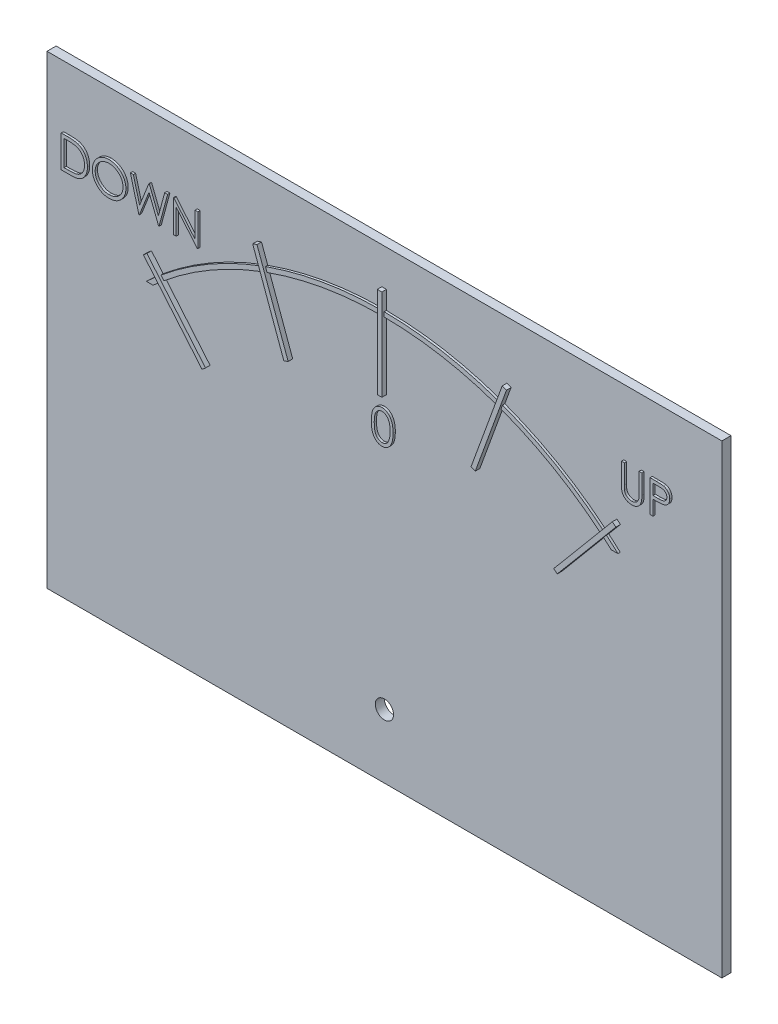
from build123d import *

# Parameters (mm, degrees)
ESQUISSE1_W             = 74
ESQUISSE1_H             = 51
BOSS_EXTRU_1_DEPTH      = 1
ESQUISSE2_R             = 1
ENL_V_MAT_EXTRU_1_DEPTH = 90.877694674
BOSS_EXTRU_2_DEPTH      = 0.25
BOSS_EXTRU_4_DEPTH      = 0.25
BOSS_EXTRU_5_DEPTH      = 0.25
ESQUISSE8_W             = 0.5
ESQUISSE8_H             = 10
BOSS_EXTRU_7_DEPTH      = 0.5
BOSS_EXTRU_8_DEPTH      = 0.25


with BuildPart() as part:
    # Esquisse1 → Boss.-Extru.1 (new body)
    with BuildSketch(Plane.XY):
        with Locations((37, 25.5)):
            Rectangle(ESQUISSE1_W, ESQUISSE1_H)
    extrude(amount=BOSS_EXTRU_1_DEPTH)

    # Esquisse2 → Enl_v. mat.-Extru.1 (cut, through all)
    with BuildSketch(Plane.XY.offset(1)):
        with Locations((37, 7)):
            Circle(ESQUISSE2_R)
    extrude(amount=-ENL_V_MAT_EXTRU_1_DEPTH, mode=Mode.SUBTRACT)

    # Esquisse3 → Boss.-Extru.2 (add)
    with BuildSketch(Plane.XY.offset(1)):
        with BuildLine():
            Line((11.145245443, 34.848369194), (11.88589374, 34.848369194))
            ThreePointArc((11.88589374, 34.848369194), (37, 44.5), (62.11410626, 34.848369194))
            Line((62.11410626, 34.848369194), (62.854754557, 34.848369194))
            ThreePointArc((62.854754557, 34.848369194), (37, 45), (11.145245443, 34.848369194))
        make_face()
    extrude(amount=BOSS_EXTRU_2_DEPTH)

    # Esquisse6 → Boss.-Extru.4 (add)
    # profile 1 of 4: a face of its own
    with BuildSketch(Plane.XY.offset(1)):
        with BuildLine():
            Line((1.810400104, 40.77481565), (1.810400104, 44.27481565))
            Line((1.810400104, 44.27481565), (2.517130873, 44.27481565))
            add(Edge.make_bspline(
                [(2.517130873, 44.27481565), (2.578599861, 44.27437308), (2.697357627, 44.273518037), (2.868970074, 44.268096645), (3.027753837, 44.25850618), (3.173186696, 44.244536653), (3.305667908, 44.22738362), (3.424826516, 44.205883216), (3.531278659, 44.180495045), (3.596748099, 44.158849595), (3.627707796, 44.148613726)],
                knots=[0, 0, 0, 0, 1.314313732, 2.53924729, 3.670748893, 4.714932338, 5.66265055, 6.526160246, 7.303039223, 8, 8, 8, 8], degree=3))
            add(Edge.make_bspline(
                [(3.627707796, 44.148613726), (3.668202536, 44.133183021), (3.748273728, 44.102671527), (3.86228085, 44.045115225), (3.969606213, 43.979902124), (4.070825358, 43.906946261), (4.163626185, 43.824181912), (4.251634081, 43.735124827), (4.331248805, 43.636536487), (4.404157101, 43.530461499), (4.469892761, 43.418149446), (4.527031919, 43.299814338), (4.574485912, 43.17605713), (4.613879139, 43.047221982), (4.644925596, 42.913025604), (4.666107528, 42.773311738), (4.680078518, 42.628632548), (4.681482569, 42.530458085), (4.682194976, 42.480644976)],
                knots=[0, 0, 0, 0, 0.984719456, 1.947108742, 2.898477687, 3.838006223, 4.779231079, 5.722358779, 6.681677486, 7.655904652, 8.64651281, 9.637519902, 10.640069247, 11.656948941, 12.698408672, 13.768548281, 14.867775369, 16, 16, 16, 16], degree=3))
            add(Edge.make_bspline(
                [(4.682194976, 42.480644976), (4.681566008, 42.437383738), (4.680326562, 42.352132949), (4.669197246, 42.226492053), (4.653020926, 42.104578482), (4.627976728, 41.986972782), (4.597574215, 41.872644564), (4.558610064, 41.76281232), (4.513974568, 41.65646851), (4.461924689, 41.555051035), (4.404783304, 41.458967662), (4.343461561, 41.368392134), (4.278024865, 41.284616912), (4.207849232, 41.2073883), (4.133841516, 41.136822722), (4.055517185, 41.072330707), (3.972674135, 41.015174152), (3.885683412, 40.963107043), (3.792007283, 40.917686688), (3.689871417, 40.879256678), (3.578840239, 40.847410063), (3.459186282, 40.820839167), (3.330702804, 40.799761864), (3.193263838, 40.785635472), (3.047080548, 40.776082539), (2.946701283, 40.775246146), (2.895035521, 40.77481565)],
                knots=[0, 0, 0, 0, 1.105936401, 2.179363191, 3.223086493, 4.248585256, 5.251745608, 6.245858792, 7.225916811, 8.198733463, 9.158002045, 10.082870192, 10.993790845, 11.873723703, 12.748670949, 13.606408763, 14.465103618, 15.319838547, 16.196477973, 17.123216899, 18.106603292, 19.147568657, 20.255746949, 21.433717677, 22.679120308, 24, 24, 24, 24], degree=3))
            Line((2.895035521, 40.77481565), (1.810400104, 40.77481565))
        make_face()
        with BuildLine():
            Line((2.124502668, 41.133790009), (2.526245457, 41.133790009))
            add(Edge.make_bspline(
                [(2.526245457, 41.133790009), (2.583973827, 41.134038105), (2.695006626, 41.134515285), (2.854664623, 41.138702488), (3.000544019, 41.145544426), (3.132665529, 41.155119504), (3.250954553, 41.167788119), (3.355658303, 41.181913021), (3.446433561, 41.199510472), (3.501362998, 41.215461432), (3.526746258, 41.222832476)],
                knots=[0, 0, 0, 0, 1.375205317, 2.645023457, 3.804390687, 4.853969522, 5.800190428, 6.637939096, 7.370582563, 8, 8, 8, 8], degree=3))
            add(Edge.make_bspline(
                [(3.526746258, 41.222832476), (3.55869462, 41.234084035), (3.621828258, 41.256318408), (3.712709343, 41.296876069), (3.797466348, 41.344918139), (3.877576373, 41.398320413), (3.951903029, 41.458966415), (4.021327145, 41.525537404), (4.085708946, 41.598372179), (4.144383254, 41.67738034), (4.196891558, 41.762070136), (4.242362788, 41.85160897), (4.282214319, 41.94501578), (4.313492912, 42.043724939), (4.338008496, 42.146853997), (4.355373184, 42.25441021), (4.366187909, 42.366373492), (4.367449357, 42.442525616), (4.368092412, 42.481346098)],
                knots=[0, 0, 0, 0, 0.998632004, 1.973411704, 2.929992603, 3.868527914, 4.809262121, 5.754881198, 6.702106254, 7.672490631, 8.653608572, 9.636854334, 10.631411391, 11.644891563, 12.686317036, 13.754757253, 14.855430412, 16, 16, 16, 16], degree=3))
            add(Edge.make_bspline(
                [(4.368092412, 42.481346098), (4.367579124, 42.522279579), (4.366570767, 42.602693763), (4.353896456, 42.720684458), (4.335374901, 42.834165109), (4.308591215, 42.943143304), (4.274460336, 43.047831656), (4.231865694, 43.147651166), (4.183199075, 43.243656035), (4.125295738, 43.333630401), (4.061880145, 43.41872351), (3.991502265, 43.496678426), (3.915280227, 43.567672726), (3.834045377, 43.632812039), (3.745508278, 43.689475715), (3.651754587, 43.740162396), (3.551408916, 43.783178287), (3.48159622, 43.80605715), (3.446117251, 43.817684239)],
                knots=[0, 0, 0, 0, 1.122418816, 2.205001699, 3.251619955, 4.274784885, 5.280384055, 6.268708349, 7.249350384, 8.229342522, 9.199999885, 10.157847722, 11.105861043, 12.055065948, 13.010012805, 13.98527497, 14.976112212, 16, 16, 16, 16], degree=3))
            add(Edge.make_bspline(
                [(3.446117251, 43.817684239), (3.416766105, 43.825800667), (3.354357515, 43.84305842), (3.252518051, 43.861883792), (3.137902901, 43.878488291), (3.0100032, 43.892546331), (2.868964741, 43.902633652), (2.714679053, 43.910204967), (2.547079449, 43.915311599), (2.430896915, 43.915660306), (2.370596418, 43.915841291)],
                knots=[0, 0, 0, 0, 0.674548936, 1.434276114, 2.292660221, 3.240891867, 4.284742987, 5.42552168, 6.663806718, 8, 8, 8, 8], degree=3))
            Line((2.370596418, 43.915841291), (2.124502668, 43.915841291))
            Line((2.124502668, 43.915841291), (2.124502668, 41.133790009))
        make_face(mode=Mode.SUBTRACT)
    # profile 2 of 4: a face of its own
    with BuildSketch(Plane.XY.offset(1)):
        with BuildLine():
            add(Edge.make_bspline(
                [(7.037964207, 44.364559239), (7.102772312, 44.36291776), (7.230060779, 44.359693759), (7.417135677, 44.335014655), (7.595730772, 44.292319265), (7.767300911, 44.235456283), (7.929793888, 44.159601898), (8.08443278, 44.067916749), (8.230849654, 43.959440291), (8.367071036, 43.835011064), (8.491727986, 43.69962761), (8.601553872, 43.5551497), (8.693596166, 43.402450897), (8.769181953, 43.241990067), (8.828480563, 43.074130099), (8.869399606, 42.897976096), (8.895537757, 42.714669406), (8.898593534, 42.589642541), (8.900143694, 42.526217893)],
                knots=[0, 0, 0, 0, 1.065120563, 2.091984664, 3.0946048, 4.079830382, 5.057816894, 6.036188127, 7.030412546, 8.04752943, 9.064399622, 10.05169764, 11.02544977, 11.989514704, 12.962713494, 13.945757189, 14.957906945, 16, 16, 16, 16], degree=3))
            add(Edge.make_bspline(
                [(8.900143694, 42.526217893), (8.898593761, 42.463260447), (8.895538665, 42.339164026), (8.869369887, 42.157020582), (8.828328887, 41.981929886), (8.769732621, 41.814184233), (8.694507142, 41.653606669), (8.601851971, 41.500619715), (8.492710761, 41.355173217), (8.36850391, 41.218860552), (8.233102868, 41.093863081), (8.087872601, 40.984944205), (7.936079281, 40.891220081), (7.775769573, 40.816436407), (7.609069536, 40.756664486), (7.434487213, 40.715911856), (7.252840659, 40.689624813), (7.128969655, 40.686606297), (7.066009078, 40.68507206)],
                knots=[0, 0, 0, 0, 1.043624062, 2.057103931, 3.04512605, 4.022047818, 4.998200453, 5.980619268, 6.982898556, 8.009068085, 9.034988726, 10.034168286, 11.015286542, 11.987931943, 12.962482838, 13.94673481, 14.956375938, 16, 16, 16, 16], degree=3))
            add(Edge.make_bspline(
                [(7.066009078, 40.68507206), (7.002584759, 40.686621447), (6.877558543, 40.689675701), (6.694021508, 40.715857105), (6.517743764, 40.756798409), (6.349229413, 40.815307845), (6.188384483, 40.890925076), (6.034894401, 40.983129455), (5.889375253, 41.092536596), (5.753033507, 41.216703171), (5.628284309, 41.351874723), (5.519524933, 41.496708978), (5.42729982, 41.648364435), (5.351936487, 41.807261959), (5.292272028, 41.972633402), (5.25156721, 42.145581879), (5.225231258, 42.325121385), (5.222196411, 42.447364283), (5.220656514, 42.50939097)],
                knots=[0, 0, 0, 0, 1.053102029, 2.075944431, 3.073151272, 4.055350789, 5.033113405, 6.020478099, 7.024410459, 8.052272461, 9.079885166, 10.07527673, 11.055994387, 12.023226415, 12.992069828, 13.970394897, 14.97016774, 16, 16, 16, 16], degree=3))
            add(Edge.make_bspline(
                [(5.220656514, 42.50939097), (5.22119115, 42.551023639), (5.222253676, 42.633763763), (5.235045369, 42.756630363), (5.25360707, 42.877521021), (5.280208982, 42.996091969), (5.315000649, 43.112052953), (5.356052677, 43.226203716), (5.406192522, 43.33738744), (5.46287317, 43.446130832), (5.526134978, 43.550738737), (5.596010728, 43.649618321), (5.670046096, 43.743599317), (5.75120949, 43.830246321), (5.836825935, 43.912079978), (5.928284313, 43.987842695), (6.025026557, 44.058217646), (6.127468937, 44.121637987), (6.233087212, 44.178997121), (6.34196399, 44.228218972), (6.452620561, 44.270465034), (6.565575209, 44.304705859), (6.680527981, 44.331737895), (6.797729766, 44.350145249), (6.917087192, 44.362969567), (6.997498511, 44.364027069), (7.037964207, 44.364559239)],
                knots=[0, 0, 0, 0, 1.037015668, 2.060948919, 3.074880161, 4.083647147, 5.086022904, 6.090072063, 7.104153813, 8.122640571, 9.144368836, 10.147691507, 11.138137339, 12.123020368, 13.103399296, 14.087645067, 15.080126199, 16.082011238, 17.087798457, 18.072939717, 19.057185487, 20.037253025, 21.01195951, 21.997135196, 22.992090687, 24, 24, 24, 24], degree=3))
        make_face()
        with BuildLine():
            add(Edge.make_bspline(
                [(7.053388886, 44.00558488), (7.020174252, 44.00517999), (6.95406252, 44.00437408), (6.855777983, 43.993758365), (6.758786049, 43.978628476), (6.663066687, 43.957046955), (6.569020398, 43.927642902), (6.475770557, 43.893801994), (6.384167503, 43.852580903), (6.294513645, 43.806008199), (6.20759857, 43.754459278), (6.125585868, 43.697487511), (6.048263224, 43.636428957), (5.975819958, 43.57114112), (5.908468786, 43.501291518), (5.844884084, 43.427939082), (5.787614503, 43.348987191), (5.735128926, 43.266576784), (5.688161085, 43.180815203), (5.646395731, 43.09260534), (5.612231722, 43.001227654), (5.584369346, 42.907673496), (5.561269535, 42.812091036), (5.546635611, 42.713755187), (5.535903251, 42.613160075), (5.535143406, 42.545178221), (5.534759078, 42.510793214)],
                knots=[0, 0, 0, 0, 1.008559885, 2.007477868, 2.99961109, 3.989939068, 4.984837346, 5.991145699, 7.001802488, 8.033829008, 9.059044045, 10.069351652, 11.065060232, 12.050310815, 13.029377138, 14.011219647, 14.996725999, 15.989392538, 16.977580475, 17.965360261, 18.951710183, 19.937753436, 20.929683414, 21.935841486, 22.955955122, 24, 24, 24, 24], degree=3))
            add(Edge.make_bspline(
                [(5.534759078, 42.510793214), (5.53603394, 42.460230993), (5.538541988, 42.360759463), (5.560499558, 42.214991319), (5.594321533, 42.074903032), (5.644178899, 41.941261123), (5.706529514, 41.81291684), (5.783556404, 41.691008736), (5.87481549, 41.575503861), (5.978479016, 41.467208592), (6.091801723, 41.368362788), (6.212134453, 41.281599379), (6.33818806, 41.208189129), (6.470291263, 41.148384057), (6.607738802, 41.100994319), (6.751416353, 41.068515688), (6.900366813, 41.047140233), (7.001897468, 41.045087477), (7.053388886, 41.044046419)],
                knots=[0, 0, 0, 0, 1.032063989, 2.030389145, 3.003944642, 3.970395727, 4.937377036, 5.913328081, 6.909231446, 7.93887556, 8.970685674, 9.976071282, 10.964166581, 11.944589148, 12.933237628, 13.927779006, 14.949070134, 16, 16, 16, 16], degree=3))
            add(Edge.make_bspline(
                [(7.053388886, 41.044046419), (7.087998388, 41.044521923), (7.156639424, 41.045464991), (7.258734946, 41.054963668), (7.358991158, 41.070195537), (7.457267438, 41.092126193), (7.553452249, 41.119573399), (7.647947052, 41.152181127), (7.739745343, 41.192862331), (7.830005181, 41.237810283), (7.916401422, 41.28905044), (7.998876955, 41.34408859), (8.075352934, 41.405057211), (8.147742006, 41.469375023), (8.215369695, 41.538338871), (8.277778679, 41.611859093), (8.334758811, 41.69039975), (8.387224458, 41.772685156), (8.434027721, 41.858681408), (8.47480682, 41.947211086), (8.509402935, 42.038056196), (8.53733144, 42.131347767), (8.559216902, 42.226908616), (8.574296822, 42.324866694), (8.584845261, 42.425026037), (8.585640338, 42.492769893), (8.58604113, 42.526919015)],
                knots=[0, 0, 0, 0, 1.047197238, 2.076906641, 3.100256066, 4.114471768, 5.12198147, 6.126382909, 7.136867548, 8.15857795, 9.17633901, 10.174870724, 11.156907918, 12.133735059, 13.104061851, 14.077631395, 15.04955518, 16.038496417, 17.029181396, 18.010275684, 18.986308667, 19.968651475, 20.955262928, 21.950658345, 22.966943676, 24, 24, 24, 24], degree=3))
            add(Edge.make_bspline(
                [(8.58604113, 42.526919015), (8.585640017, 42.560834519), (8.584844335, 42.628112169), (8.574301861, 42.727572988), (8.55920097, 42.824826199), (8.537438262, 42.919490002), (8.509388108, 43.011588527), (8.474800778, 43.101035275), (8.434015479, 43.18816347), (8.387207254, 43.272757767), (8.334591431, 43.353932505), (8.277097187, 43.431534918), (8.213731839, 43.504107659), (8.146305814, 43.573442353), (8.073134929, 43.638060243), (7.994550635, 43.697982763), (7.911506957, 43.754656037), (7.823579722, 43.805781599), (7.732835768, 43.852995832), (7.63972181, 43.893446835), (7.54529271, 43.927818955), (7.449788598, 43.95713592), (7.35240562, 43.97854395), (7.253801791, 43.993772), (7.154113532, 44.004370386), (7.087070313, 44.005178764), (7.053388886, 44.00558488)],
                knots=[0, 0, 0, 0, 1.02996197, 2.043119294, 3.035359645, 4.018872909, 4.991431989, 5.957985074, 6.929999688, 7.912076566, 8.892894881, 9.867085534, 10.843653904, 11.817741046, 12.803660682, 13.806313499, 14.818574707, 15.856120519, 16.894564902, 17.924820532, 18.937903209, 19.946497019, 20.957711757, 21.963978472, 22.977135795, 24, 24, 24, 24], degree=3))
        make_face(mode=Mode.SUBTRACT)
    # profile 3 of 4: a face of its own
    with BuildSketch(Plane.XY.offset(1)):
        Polygon((9.393733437, 44.27481565), (9.718352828, 44.27481565), (10.403348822, 41.708008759), (11.42207879, 44.27481565), (11.467651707, 44.27481565), (12.467451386, 41.725536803), (13.155952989, 44.27481565), (13.477066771, 44.27481565), (12.533356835, 40.77481565), (12.48848504, 40.77481565), (11.435400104, 43.451698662), (10.369694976, 40.77481565), (10.324823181, 40.77481565), align=None)
    # profile 4 of 4: a face of its own
    with BuildSketch(Plane.XY.offset(1)):
        Polygon((14.105271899, 40.77481565), (14.105271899, 44.27481565), (14.171177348, 44.27481565), (16.483477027, 41.520108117), (16.483477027, 44.27481565), (16.797579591, 44.27481565), (16.797579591, 40.77481565), (16.726065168, 40.77481565), (14.419374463, 43.523213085), (14.419374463, 40.77481565), align=None)
    extrude(amount=BOSS_EXTRU_4_DEPTH)

    # Esquisse7 → Boss.-Extru.5 (add)
    # profile 1 of 2: a face of its own
    with BuildSketch(Plane.XY.offset(1)):
        with BuildLine():
            Line((63.237395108, 43.820921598), (63.551497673, 43.820921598))
            Line((63.551497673, 43.820921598), (63.551497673, 41.723866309))
            add(Edge.make_bspline(
                [(63.551497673, 41.723866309), (63.551450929, 41.694185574), (63.551362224, 41.637861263), (63.551954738, 41.557692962), (63.553614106, 41.486420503), (63.554660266, 41.423769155), (63.556987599, 41.370026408), (63.558885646, 41.324901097), (63.561326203, 41.288606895), (63.56425932, 41.267425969), (63.565520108, 41.258321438)],
                knots=[0, 0, 0, 0, 1.528628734, 2.90083645, 4.128790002, 5.200304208, 6.127813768, 6.898992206, 7.526736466, 8, 8, 8, 8], degree=3))
            add(Edge.make_bspline(
                [(63.565520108, 41.258321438), (63.570697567, 41.225474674), (63.580760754, 41.161631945), (63.606407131, 41.070723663), (63.642224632, 40.988792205), (63.684667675, 40.913280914), (63.740600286, 40.846291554), (63.807603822, 40.784579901), (63.88878159, 40.730608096), (63.979042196, 40.681257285), (64.076327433, 40.641592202), (64.1757387, 40.611598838), (64.275781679, 40.593319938), (64.342757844, 40.591203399), (64.376016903, 40.590152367)],
                knots=[0, 0, 0, 0, 1.035780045, 2.013197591, 2.933192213, 3.817615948, 4.702609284, 5.640816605, 6.646850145, 7.73207398, 8.84249596, 9.914020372, 10.964143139, 12, 12, 12, 12], degree=3))
            add(Edge.make_bspline(
                [(64.376016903, 40.590152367), (64.404570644, 40.591226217), (64.461513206, 40.593367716), (64.546119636, 40.606629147), (64.628519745, 40.630529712), (64.709120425, 40.661369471), (64.784671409, 40.702117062), (64.855214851, 40.749187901), (64.918178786, 40.804398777), (64.975636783, 40.865499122), (65.025671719, 40.934438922), (65.069042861, 41.00971706), (65.10456879, 41.092466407), (65.122112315, 41.150620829), (65.131125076, 41.180496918)],
                knots=[0, 0, 0, 0, 0.994687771, 1.983630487, 2.973142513, 3.978332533, 4.983357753, 5.956394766, 6.925816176, 7.893390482, 8.871859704, 9.88551698, 10.913711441, 12, 12, 12, 12], degree=3))
            add(Edge.make_bspline(
                [(65.131125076, 41.180496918), (65.134125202, 41.192845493), (65.14081069, 41.220363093), (65.147057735, 41.266884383), (65.15356426, 41.321773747), (65.15807883, 41.38542556), (65.162480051, 41.457626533), (65.165113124, 41.53875279), (65.166330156, 41.628509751), (65.166692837, 41.691146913), (65.166882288, 41.723866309)],
                knots=[0, 0, 0, 0, 0.558680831, 1.244966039, 2.062412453, 2.990489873, 4.051219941, 5.244515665, 6.560634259, 8, 8, 8, 8], degree=3))
            Line((65.166882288, 41.723866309), (65.166882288, 43.820921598))
            Line((65.166882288, 43.820921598), (65.480984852, 43.820921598))
            Line((65.480984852, 43.820921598), (65.480984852, 41.707039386))
            add(Edge.make_bspline(
                [(65.480984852, 41.707039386), (65.480730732, 41.668941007), (65.4802348, 41.594589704), (65.475934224, 41.485638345), (65.469077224, 41.382285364), (65.459389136, 41.284516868), (65.446552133, 41.192682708), (65.432276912, 41.10597794), (65.414097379, 41.025024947), (65.392863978, 40.94919253), (65.36859043, 40.877007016), (65.337149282, 40.808498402), (65.301724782, 40.741584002), (65.259710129, 40.677275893), (65.212498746, 40.61528934), (65.159047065, 40.556000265), (65.101122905, 40.498461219), (65.037763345, 40.444148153), (64.97001282, 40.394339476), (64.898072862, 40.350541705), (64.822496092, 40.313518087), (64.743478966, 40.283042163), (64.660987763, 40.260127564), (64.575020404, 40.243052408), (64.48538121, 40.23335011), (64.424416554, 40.23190818), (64.393544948, 40.231178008)],
                knots=[0, 0, 0, 0, 1.316592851, 2.569410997, 3.76748051, 4.895814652, 5.963796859, 6.97159953, 7.931736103, 8.829262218, 9.692595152, 10.560224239, 11.431080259, 12.30701507, 13.211635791, 14.121146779, 15.063487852, 16.031507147, 17.00238618, 17.966455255, 18.938106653, 19.907068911, 20.888905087, 21.893141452, 22.933117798, 24, 24, 24, 24], degree=3))
            add(Edge.make_bspline(
                [(64.393544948, 40.231178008), (64.359875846, 40.231962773), (64.293817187, 40.23350248), (64.196479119, 40.24232523), (64.103164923, 40.258943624), (64.012889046, 40.280103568), (63.926880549, 40.309287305), (63.843987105, 40.34338543), (63.765628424, 40.385262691), (63.690533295, 40.431856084), (63.620708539, 40.484280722), (63.556611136, 40.541420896), (63.498135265, 40.602361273), (63.446266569, 40.667761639), (63.400145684, 40.737113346), (63.360415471, 40.810612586), (63.326302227, 40.888230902), (63.30869566, 40.942184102), (63.299794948, 40.969459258)],
                knots=[0, 0, 0, 0, 1.13879206, 2.234305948, 3.301075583, 4.341971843, 5.366689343, 6.369221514, 7.369726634, 8.367512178, 9.355451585, 10.318319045, 11.268648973, 12.207971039, 13.137398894, 14.081662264, 15.030215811, 16, 16, 16, 16], degree=3))
            add(Edge.make_bspline(
                [(63.299794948, 40.969459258), (63.29461779, 40.988091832), (63.283388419, 41.028506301), (63.271363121, 41.09539279), (63.261254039, 41.172407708), (63.251748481, 41.259556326), (63.246139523, 41.356906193), (63.241222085, 41.464415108), (63.237360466, 41.58221307), (63.237383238, 41.664267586), (63.237395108, 41.707039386)],
                knots=[0, 0, 0, 0, 0.625038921, 1.35572334, 2.194682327, 3.136881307, 4.189498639, 5.346923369, 6.617055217, 8, 8, 8, 8], degree=3))
            Line((63.237395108, 41.707039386), (63.237395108, 43.820921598))
        make_face()
    # profile 2 of 2: a face of its own
    with BuildSketch(Plane.XY.offset(1)):
        with BuildLine():
            Line((66.37842075, 43.820921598), (67.064818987, 43.820921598))
            add(Edge.make_bspline(
                [(67.064818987, 43.820921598), (67.112029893, 43.820869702), (67.202488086, 43.820770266), (67.332203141, 43.81775552), (67.450012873, 43.813728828), (67.555663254, 43.808146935), (67.649479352, 43.801550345), (67.731036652, 43.792298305), (67.800976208, 43.78263801), (67.842882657, 43.772816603), (67.861994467, 43.768337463)],
                knots=[0, 0, 0, 0, 1.415646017, 2.712440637, 3.8905458, 4.950247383, 5.884950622, 6.709939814, 7.411656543, 8, 8, 8, 8], degree=3))
            add(Edge.make_bspline(
                [(67.861994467, 43.768337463), (67.886188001, 43.761715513), (67.934004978, 43.748627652), (68.002906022, 43.722413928), (68.068459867, 43.691331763), (68.130891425, 43.655907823), (68.189433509, 43.614622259), (68.24495955, 43.569148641), (68.29697953, 43.518437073), (68.345200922, 43.463056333), (68.389485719, 43.403936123), (68.427615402, 43.340193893), (68.459542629, 43.27290259), (68.486925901, 43.202109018), (68.506634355, 43.127218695), (68.521481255, 43.048751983), (68.530904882, 42.966717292), (68.531807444, 42.910657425), (68.532266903, 42.882119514)],
                knots=[0, 0, 0, 0, 0.999701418, 1.975846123, 2.934577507, 3.890451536, 4.834027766, 5.787354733, 6.749476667, 7.726910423, 8.712836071, 9.690891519, 10.682875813, 11.679750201, 12.712814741, 13.765529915, 14.8625177, 16, 16, 16, 16], degree=3))
            add(Edge.make_bspline(
                [(68.532266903, 42.882119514), (68.531845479, 42.853341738), (68.531020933, 42.797036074), (68.521124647, 42.714663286), (68.507794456, 42.635944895), (68.487297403, 42.561055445), (68.46045173, 42.490439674), (68.428959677, 42.423018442), (68.390976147, 42.359938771), (68.347331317, 42.300971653), (68.298779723, 42.246061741), (68.245526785, 42.195606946), (68.187787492, 42.149902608), (68.125745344, 42.108846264), (68.058795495, 42.073389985), (67.987953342, 42.04163268), (67.912603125, 42.014961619), (67.860460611, 42.000931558), (67.833949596, 41.9937982)],
                knots=[0, 0, 0, 0, 1.121902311, 2.195077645, 3.232258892, 4.234102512, 5.217864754, 6.176164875, 7.132989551, 8.084763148, 9.034132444, 9.988522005, 10.94243251, 11.903244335, 12.886203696, 13.894208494, 14.929344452, 16, 16, 16, 16], degree=3))
            add(Edge.make_bspline(
                [(67.833949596, 41.9937982), (67.812022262, 41.989135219), (67.763967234, 41.978916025), (67.684824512, 41.967507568), (67.592679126, 41.957769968), (67.487656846, 41.95046883), (67.369851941, 41.944218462), (67.239200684, 41.939250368), (67.095446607, 41.936520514), (66.995175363, 41.936379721), (66.942823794, 41.936306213)],
                knots=[0, 0, 0, 0, 0.601384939, 1.31797006, 2.144135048, 3.087295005, 4.142315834, 5.309527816, 6.595305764, 8, 8, 8, 8], degree=3))
            Line((66.942823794, 41.936306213), (66.692523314, 41.936306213))
            Line((66.692523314, 41.936306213), (66.692523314, 40.320921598))
            Line((66.692523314, 40.320921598), (66.37842075, 40.320921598))
            Line((66.37842075, 40.320921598), (66.37842075, 43.820921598))
        make_face()
        with BuildLine():
            Line((66.692523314, 43.461947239), (66.692523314, 42.295280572))
            Line((66.692523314, 42.295280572), (67.305303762, 42.287568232))
            add(Edge.make_bspline(
                [(67.305303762, 42.287568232), (67.335223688, 42.287552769), (67.392983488, 42.287522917), (67.476419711, 42.29150814), (67.553828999, 42.296108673), (67.624973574, 42.302844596), (67.689885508, 42.312365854), (67.748673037, 42.321977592), (67.80088032, 42.335882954), (67.861979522, 42.354606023), (67.930062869, 42.386538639), (68.004130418, 42.432888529), (68.066901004, 42.491969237), (68.121219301, 42.558397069), (68.164325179, 42.632296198), (68.195881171, 42.711365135), (68.214422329, 42.794792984), (68.216908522, 42.851881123), (68.218164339, 42.880717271)],
                knots=[0, 0, 0, 0, 1.160613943, 2.240541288, 3.23993089, 4.169200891, 5.011653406, 5.7853311, 6.478053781, 7.106038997, 8.262395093, 9.384106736, 10.481365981, 11.59014053, 12.70357646, 13.786202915, 14.881775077, 16, 16, 16, 16], degree=3))
            add(Edge.make_bspline(
                [(68.218164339, 42.880717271), (68.216901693, 42.908855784), (68.214391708, 42.964791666), (68.195735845, 43.046770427), (68.164386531, 43.125006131), (68.120929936, 43.197979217), (68.068188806, 43.264168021), (68.006889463, 43.321665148), (67.937176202, 43.367886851), (67.872327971, 43.397720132), (67.814726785, 43.415935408), (67.764694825, 43.428680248), (67.70820415, 43.438855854), (67.645236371, 43.447095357), (67.576279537, 43.454148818), (67.500741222, 43.458934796), (67.418907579, 43.461736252), (67.362097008, 43.461875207), (67.332647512, 43.461947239)],
                knots=[0, 0, 0, 0, 1.120700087, 2.227813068, 3.331159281, 4.466773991, 5.599788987, 6.693661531, 7.80175334, 8.91857717, 9.525282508, 10.207424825, 10.974604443, 11.810962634, 12.737642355, 13.736264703, 14.826523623, 16, 16, 16, 16], degree=3))
            Line((67.332647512, 43.461947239), (66.692523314, 43.461947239))
        make_face(mode=Mode.SUBTRACT)
    extrude(amount=BOSS_EXTRU_5_DEPTH)

    # Esquisse8 → Boss.-Extru.7 (add)
    with BuildSketch(Plane.XY.offset(1)):
        Polygon((11.07101751, 37.457968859), (17.498893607, 29.797524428), (17.881915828, 30.118918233), (11.454039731, 37.779362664), align=None)
        Polygon((23.051965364, 44.489362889), (26.472166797, 35.092436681), (26.942013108, 35.263446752), (23.521811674, 44.66037296), align=None)
        with Locations((36.965252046, 41.99898647)):
            Rectangle(ESQUISSE8_W, ESQUISSE8_H)
        Polygon((50.412883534, 44.68414196), (46.992682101, 35.287215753), (47.462528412, 35.116205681), (50.882729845, 44.513131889), align=None)
        Polygon((62.492723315, 37.824033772), (56.064847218, 30.163589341), (56.44786944, 29.842195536), (62.875745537, 37.502639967), align=None)
    extrude(amount=BOSS_EXTRU_7_DEPTH)

    # Esquisse10 → Boss.-Extru.8 (add)
    with BuildSketch(Plane.XY.offset(1)):
        with BuildLine():
            add(Edge.make_bspline(
                [(35.814559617, 33.94353502), (35.814887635, 33.999632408), (35.815524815, 34.108602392), (35.822613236, 34.267387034), (35.834388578, 34.416347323), (35.850525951, 34.555490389), (35.870163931, 34.684852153), (35.896379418, 34.804086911), (35.92619222, 34.913746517), (35.960744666, 35.014188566), (35.999732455, 35.106766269), (36.042166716, 35.19319147), (36.08973151, 35.273333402), (36.139708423, 35.348471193), (36.194120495, 35.417374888), (36.251419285, 35.48101755), (36.313841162, 35.537928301), (36.37926417, 35.589774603), (36.448280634, 35.635224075), (36.518923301, 35.675256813), (36.591678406, 35.70945668), (36.666744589, 35.736347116), (36.743447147, 35.758557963), (36.822054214, 35.773746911), (36.902695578, 35.783303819), (36.957127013, 35.784217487), (36.984731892, 35.784680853)],
                knots=[0, 0, 0, 0, 1.646270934, 3.197905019, 4.663502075, 6.030701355, 7.308322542, 8.50163776, 9.611534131, 10.641858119, 11.616356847, 12.558055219, 13.465016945, 14.349605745, 15.204443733, 16.039544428, 16.859896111, 17.680448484, 18.487036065, 19.28249412, 20.06191084, 20.843045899, 21.620316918, 22.403196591, 23.190181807, 24, 24, 24, 24], degree=3))
            add(Edge.make_bspline(
                [(36.984731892, 35.784680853), (37.012567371, 35.784193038), (37.06792338, 35.783222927), (37.149763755, 35.773898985), (37.229713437, 35.758427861), (37.307431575, 35.736506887), (37.383556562, 35.70931121), (37.45749297, 35.675224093), (37.529700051, 35.635545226), (37.599030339, 35.588921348), (37.666244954, 35.536939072), (37.729692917, 35.478176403), (37.789380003, 35.413226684), (37.846055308, 35.34278482), (37.898110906, 35.265499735), (37.947684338, 35.182715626), (37.992056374, 35.092984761), (38.034791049, 34.997804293), (38.071678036, 34.894540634), (38.104944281, 34.783775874), (38.131823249, 34.664201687), (38.154212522, 34.536445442), (38.171557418, 34.400037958), (38.18419006, 34.255271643), (38.190863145, 34.102051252), (38.192119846, 33.997293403), (38.192764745, 33.94353502)],
                knots=[0, 0, 0, 0, 0.810914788, 1.612654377, 2.396697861, 3.181598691, 3.963628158, 4.749916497, 5.551656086, 6.361998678, 7.18212741, 8.025565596, 8.878627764, 9.750805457, 10.657531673, 11.591944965, 12.560506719, 13.57287815, 14.630710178, 15.753379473, 16.941251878, 18.199788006, 19.531962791, 20.947069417, 22.433333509, 24, 24, 24, 24], degree=3))
            add(Edge.make_bspline(
                [(38.192764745, 33.94353502), (38.19211316, 33.890011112), (38.190843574, 33.78572196), (38.184264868, 33.633190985), (38.171306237, 33.489192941), (38.155096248, 33.353382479), (38.132645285, 33.22632486), (38.105040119, 33.107580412), (38.074389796, 32.99663634), (38.036555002, 32.894401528), (37.995144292, 32.799449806), (37.950089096, 32.710782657), (37.901819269, 32.627616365), (37.849230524, 32.550616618), (37.793177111, 32.479237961), (37.732459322, 32.414740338), (37.668788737, 32.355569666), (37.601376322, 32.302918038), (37.53096477, 32.256833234), (37.459005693, 32.215619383), (37.38422231, 32.182386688), (37.308309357, 32.153851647), (37.230180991, 32.132051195), (37.149934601, 32.11697734), (37.067978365, 32.106405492), (37.012576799, 32.105599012), (36.984731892, 32.105193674)],
                knots=[0, 0, 0, 0, 1.561518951, 3.042555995, 4.452378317, 5.7783523, 7.031515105, 8.214008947, 9.334062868, 10.386615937, 11.391082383, 12.354592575, 13.286541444, 14.194233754, 15.072674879, 15.931287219, 16.775624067, 17.606195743, 18.42308326, 19.229000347, 20.022332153, 20.807536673, 21.593273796, 22.3848459, 23.188221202, 24, 24, 24, 24], degree=3))
            add(Edge.make_bspline(
                [(36.984731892, 32.105193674), (36.957127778, 32.105660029), (36.902697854, 32.106579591), (36.822045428, 32.116093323), (36.743762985, 32.131388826), (36.667464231, 32.15280543), (36.592757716, 32.179020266), (36.520661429, 32.21317395), (36.450373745, 32.252508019), (36.382082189, 32.29730344), (36.317070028, 32.348625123), (36.254971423, 32.405389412), (36.197346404, 32.469012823), (36.143712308, 32.538490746), (36.09273822, 32.613183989), (36.045848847, 32.694112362), (36.002477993, 32.780954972), (35.962834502, 32.874272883), (35.927685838, 32.975427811), (35.89663813, 33.085576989), (35.872123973, 33.205692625), (35.851141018, 33.334809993), (35.834216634, 33.473483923), (35.822662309, 33.621789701), (35.815520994, 33.77963491), (35.814885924, 33.887904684), (35.814559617, 33.94353502)],
                knots=[0, 0, 0, 0, 0.810891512, 1.598919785, 2.382837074, 3.152667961, 3.926044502, 4.706494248, 5.493654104, 6.291793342, 7.103789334, 7.925228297, 8.761435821, 9.622817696, 10.50288917, 11.416980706, 12.369136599, 13.353924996, 14.394355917, 15.514179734, 16.714354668, 17.994756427, 19.357759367, 20.818452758, 22.365282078, 24, 24, 24, 24], degree=3))
        make_face()
        with BuildLine():
            add(Edge.make_bspline(
                [(36.128662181, 33.944937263), (36.128781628, 33.898188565), (36.129013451, 33.80745852), (36.135069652, 33.675615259), (36.143319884, 33.55264493), (36.153961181, 33.438391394), (36.16976413, 33.333241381), (36.187470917, 33.236471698), (36.209019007, 33.148594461), (36.234514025, 33.06900665), (36.263553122, 32.996357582), (36.295258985, 32.928756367), (36.329319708, 32.86540443), (36.367438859, 32.806870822), (36.408953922, 32.752964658), (36.452927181, 32.702731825), (36.500999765, 32.657934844), (36.567503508, 32.604207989), (36.655299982, 32.548688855), (36.765920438, 32.500342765), (36.879588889, 32.469960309), (36.956740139, 32.466096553), (36.995248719, 32.464168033)],
                knots=[0, 0, 0, 0, 1.459021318, 2.831673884, 4.118529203, 5.306027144, 6.411944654, 7.436330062, 8.375795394, 9.233974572, 10.042671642, 10.816086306, 11.563610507, 12.285937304, 12.993564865, 13.685989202, 14.367179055, 15.041617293, 16.353048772, 17.594441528, 18.799311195, 20, 20, 20, 20], degree=3))
            add(Edge.make_bspline(
                [(36.995248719, 32.464168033), (37.034006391, 32.465765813), (37.111441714, 32.468958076), (37.224575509, 32.499756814), (37.334405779, 32.546226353), (37.42047772, 32.601173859), (37.485960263, 32.653502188), (37.532877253, 32.698116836), (37.575939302, 32.748072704), (37.616781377, 32.801972), (37.654240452, 32.860844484), (37.68830359, 32.924407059), (37.719386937, 32.992836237), (37.737095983, 33.040605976), (37.746150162, 33.065029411)],
                knots=[0, 0, 0, 0, 1.353760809, 2.704726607, 4.075137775, 5.516104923, 6.260822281, 7.007110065, 7.778089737, 8.566572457, 9.372053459, 10.217411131, 11.088608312, 12, 12, 12, 12], degree=3))
            add(Edge.make_bspline(
                [(37.746150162, 33.065029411), (37.756701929, 33.09625915), (37.778126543, 33.159668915), (37.805738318, 33.258032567), (37.827483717, 33.361235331), (37.847047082, 33.468660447), (37.860400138, 33.581100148), (37.871147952, 33.698206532), (37.877478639, 33.820067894), (37.87826339, 33.902862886), (37.878662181, 33.944937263)],
                knots=[0, 0, 0, 0, 0.884706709, 1.796334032, 2.740027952, 3.714592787, 4.726048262, 5.777819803, 6.87074269, 8, 8, 8, 8], degree=3))
            add(Edge.make_bspline(
                [(37.878662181, 33.944937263), (37.878111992, 33.987004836), (37.877035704, 34.069298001), (37.872921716, 34.189816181), (37.862298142, 34.304283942), (37.850499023, 34.413194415), (37.833101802, 34.515944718), (37.814343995, 34.613395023), (37.789142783, 34.704338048), (37.762223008, 34.790197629), (37.731412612, 34.869998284), (37.697496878, 34.94411207), (37.661275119, 35.012896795), (37.621932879, 35.076163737), (37.579937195, 35.13419628), (37.534179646, 35.185830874), (37.486475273, 35.232667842), (37.419658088, 35.286130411), (37.332183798, 35.340642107), (37.223338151, 35.390807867), (37.110067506, 35.419616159), (37.033494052, 35.423677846), (36.995248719, 35.425706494)],
                knots=[0, 0, 0, 0, 1.31362396, 2.569729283, 3.763502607, 4.902122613, 5.988968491, 7.01645872, 7.998833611, 8.933434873, 9.825090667, 10.667526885, 11.477055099, 12.250526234, 12.991942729, 13.710640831, 14.402115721, 15.076753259, 16.378508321, 17.609869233, 18.806226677, 20, 20, 20, 20], degree=3))
            add(Edge.make_bspline(
                [(36.995248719, 35.425706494), (36.956538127, 35.423675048), (36.879046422, 35.419608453), (36.764598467, 35.3909152), (36.654894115, 35.340902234), (36.567651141, 35.285949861), (36.500787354, 35.23361155), (36.453704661, 35.188225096), (36.409558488, 35.138578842), (36.368890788, 35.084176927), (36.330801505, 35.025711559), (36.295820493, 34.962722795), (36.264303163, 34.89489143), (36.235218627, 34.822274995), (36.209645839, 34.742694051), (36.188551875, 34.654925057), (36.169064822, 34.558463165), (36.155269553, 34.452743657), (36.143005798, 34.338461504), (36.13512445, 34.215184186), (36.128993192, 34.083119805), (36.128774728, 33.991920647), (36.128662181, 33.944937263)],
                knots=[0, 0, 0, 0, 1.207732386, 2.417664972, 3.655092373, 4.956220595, 5.625982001, 6.301752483, 6.994047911, 7.697131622, 8.419323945, 9.170223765, 9.943494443, 10.752040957, 11.610060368, 12.549350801, 13.567764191, 14.679664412, 15.874934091, 17.154273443, 18.533957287, 20, 20, 20, 20], degree=3))
        make_face(mode=Mode.SUBTRACT)
    extrude(amount=BOSS_EXTRU_8_DEPTH)


solid = part.part
